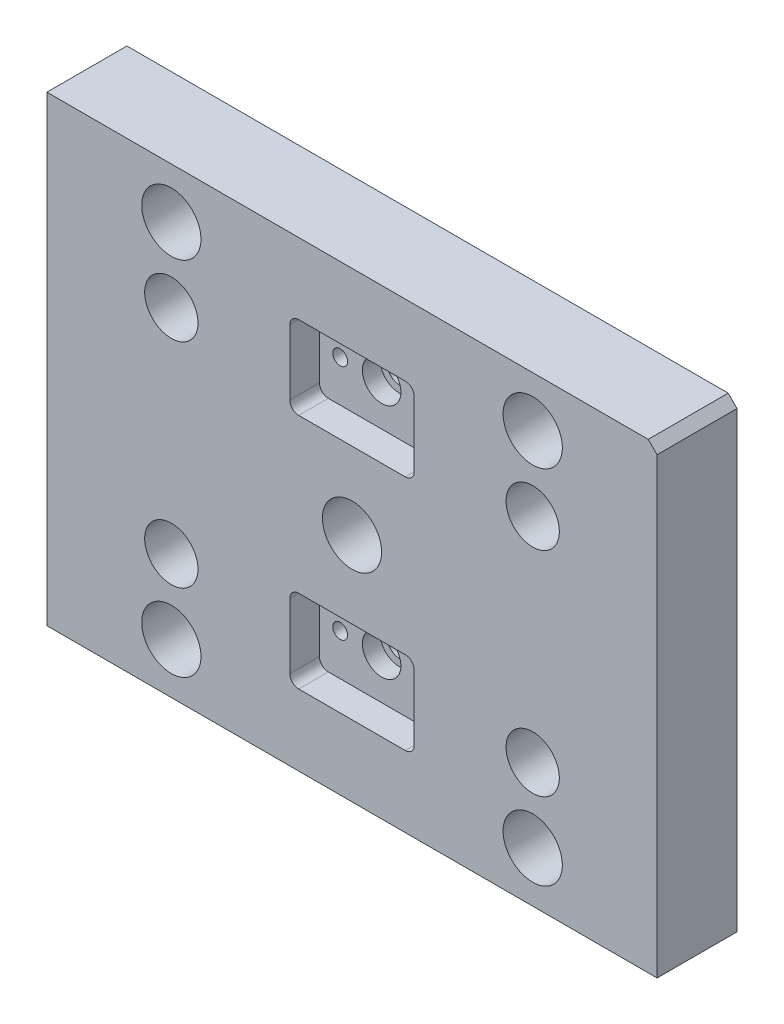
from build123d import *

# Parameters (mm, degrees)
ESQUISSE1_W                 = 206
ESQUISSE1_H                 = 156
EXTRUSION1_DEPTH            = 27
ESQUISSE3_R                 = 10
ESQUISSE3_R_2               = 5.25
ENL_V_MAT_EXTRU_1_DEPTH     = 132.992424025
ESQUISSE13_R                = 9
ENL_V_MAT_EXTRU_9_DEPTH     = 13
SYM_TRIE2_COPY_1_SKETCH_R   = 10
SYM_TRIE2_COPY_1_SKETCH_R_2 = 5.25
SYM_TRIE2_COPY_1_DEPTH      = 132.992424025
SYM_TRIE2_COPY_2_SKETCH_R   = 9
SYM_TRIE2_COPY_2_DEPTH      = 13
ESQUISSE10_W                = 42
ESQUISSE10_H                = 28
ENL_V_MAT_EXTRU_6_DEPTH     = 10
CONG_1_R                    = 3
ESQUISSE17_R                = 10
ENL_V_MAT_EXTRU_12_DEPTH    = 132.992424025
CHANFREIN_D_SIZE            = 3
CONG_1_OF_SYM_TRIE3_R       = 3
ESQUISSE18_R                = 4.1
ENL_V_MAT_EXTRU_13_DEPTH    = 132.992424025
ESQUISSE19_R                = 6.5
ENL_V_MAT_EXTRU_14_DEPTH    = 6
TROU_TARAUD_M61_AT_2_COUNT  = 2
TROU_TARAUD_M61_AT_2_PITCH  = 28


with BuildPart() as part:
    # Esquisse1 → Extrusion1 (new body)
    with BuildSketch(Plane.XY):
        Rectangle(ESQUISSE1_W, ESQUISSE1_H)
    extrude(amount=EXTRUSION1_DEPTH)

    # Esquisse3 → Enl_v. mat.-Extru.1 (cut, through all)
    with BuildSketch(Plane.XY.offset(27)):
        with Locations((-61, 61)):
            Circle(ESQUISSE3_R)
        with Locations((-61, 36)):
            Circle(ESQUISSE3_R_2)
    enl_v_mat_extru_1 = extrude(amount=-ENL_V_MAT_EXTRU_1_DEPTH, mode=Mode.SUBTRACT)

    # Esquisse13 → Enl_v. mat.-Extru.9 (cut)
    with BuildSketch(Plane.XY.offset(27)):
        with Locations((-61, 36)):
            Circle(ESQUISSE13_R)
    enl_v_mat_extru_9 = extrude(amount=-ENL_V_MAT_EXTRU_9_DEPTH, mode=Mode.SUBTRACT)

    # Sym_trie1: Enl_v. mat.-Extru.1, Enl_v. mat.-Extru.9 across plane
    add(enl_v_mat_extru_1.mirror(Plane(origin=(0, 0, 0), x_dir=(0, 0, 1), z_dir=(1, 0, 0))), mode=Mode.SUBTRACT)
    add(enl_v_mat_extru_9.mirror(Plane(origin=(0, 0, 0), x_dir=(0, 0, 1), z_dir=(1, 0, 0))), mode=Mode.SUBTRACT)

    # Sym_trie2: Enl_v. mat.-Extru.1, Enl_v. mat.-Extru.9 across plane
    add(enl_v_mat_extru_1.mirror(Plane.ZX), mode=Mode.SUBTRACT)
    add(enl_v_mat_extru_9.mirror(Plane.ZX), mode=Mode.SUBTRACT)

    # Sym_trie2 copy 1 sketch → Sym_trie2 copy 1 (cut, through all)
    with BuildSketch(Plane(origin=(0, 0, 27), x_dir=(-1, 0, 0), z_dir=(0, 0, 1))):
        with Locations((-61, 61)):
            Circle(SYM_TRIE2_COPY_1_SKETCH_R)
        with Locations((-61, 36)):
            Circle(SYM_TRIE2_COPY_1_SKETCH_R_2)
    extrude(amount=-SYM_TRIE2_COPY_1_DEPTH, mode=Mode.SUBTRACT)

    # Sym_trie2 copy 2 sketch → Sym_trie2 copy 2 (cut)
    with BuildSketch(Plane(origin=(0, 0, 27), x_dir=(-1, 0, 0), z_dir=(0, 0, 1))):
        with Locations((-61, 36)):
            Circle(SYM_TRIE2_COPY_2_SKETCH_R)
    extrude(amount=-SYM_TRIE2_COPY_2_DEPTH, mode=Mode.SUBTRACT)

    # Esquisse10 → Enl_v. mat.-Extru.6 (cut)
    with BuildSketch(Plane.XY.offset(27)):
        with Locations((0, -40)):
            Rectangle(ESQUISSE10_W, ESQUISSE10_H)
    enl_v_mat_extru_6 = extrude(amount=-ENL_V_MAT_EXTRU_6_DEPTH, mode=Mode.SUBTRACT)

    # Cong_1
    cong_1_edges = [part.edges().sort_by_distance(p)[0] for p in [
        (-21, -54, 22),
        (-21, -26, 22),
        (21, -26, 22),
        (21, -54, 22),
    ]]
    fillet(cong_1_edges, radius=CONG_1_R)

    # Esquisse17 → Enl_v. mat.-Extru.12 (cut, through all)
    with BuildSketch(Plane.XY.offset(27)):
        Circle(ESQUISSE17_R)
    extrude(amount=-ENL_V_MAT_EXTRU_12_DEPTH, mode=Mode.SUBTRACT)

    # Chanfrein_D
    chanfrein_d_edges = [part.edges().sort_by_distance(p)[0] for p in [
        (103, 78, 13.5),
    ]]
    chamfer(chanfrein_d_edges, length=CHANFREIN_D_SIZE)

    # Sym_trie3: Enl_v. mat.-Extru.6 across plane
    add(enl_v_mat_extru_6.mirror(Plane.ZX), mode=Mode.SUBTRACT)

    # Cong_1 of Sym_trie3
    cong_1_of_sym_trie3_edges = [part.edges().sort_by_distance(p)[0] for p in [
        (-21, 54, 22),
        (-21, 26, 22),
        (21, 26, 22),
        (21, 54, 22),
    ]]
    fillet(cong_1_of_sym_trie3_edges, radius=CONG_1_OF_SYM_TRIE3_R)

    # Esquisse18 → Enl_v. mat.-Extru.13 (cut, through all)
    with BuildSketch(Plane(origin=(0, 0, 0), x_dir=(-1, 0, 0), z_dir=(0, 0, -1))):
        with Locations((0, -40)):
            Circle(ESQUISSE18_R)
        with Locations((0, 40)):
            Circle(ESQUISSE18_R)
    extrude(amount=-ENL_V_MAT_EXTRU_13_DEPTH, mode=Mode.SUBTRACT)

    # Esquisse19 → Enl_v. mat.-Extru.14 (cut)
    with BuildSketch(Plane.XY.offset(17)):
        with Locations((0, 40)):
            Circle(ESQUISSE19_R)
        with Locations((0, -40)):
            Circle(ESQUISSE19_R)
    extrude(amount=-ENL_V_MAT_EXTRU_14_DEPTH, mode=Mode.SUBTRACT)

    # Esquisse21 → Trou taraud_ M61 (revolve, cut)
    with BuildSketch(Plane(origin=(14, 40, 17), x_dir=(0, -1, 0), z_dir=(1, 0, 0))):
        Polygon((0, 0), (0, 18.502151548), (2.5, 17), (2.5, 0), align=None)
    trou_taraud_m61 = revolve(axis=Axis((14, 40, 23.35), (0, 0, -1)), mode=Mode.SUBTRACT)

    # Trou taraud_ M61 at 2: Trou taraud_ M61 ×2
    with Locations(*[(-i * TROU_TARAUD_M61_AT_2_PITCH, 0, 0) for i in range(1, TROU_TARAUD_M61_AT_2_COUNT)]):
        add(trou_taraud_m61, mode=Mode.SUBTRACT)

    # Sym_trie4: Trou taraud_ M61 across plane
    add(trou_taraud_m61.mirror(Plane.ZX), mode=Mode.SUBTRACT)

    # Sym_trie4 copy 1 sketch → Sym_trie4 copy 1 (revolve, cut)
    with BuildSketch(Plane(origin=(-14, -40, 17), x_dir=(0, 1, 0), z_dir=(1, 0, 0))):
        Polygon((0, 0), (0, -18.502151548), (2.5, -17), (2.5, 0), align=None)
    revolve(axis=Axis((-14, -40, 23.35), (0, 0, 1)), mode=Mode.SUBTRACT)


solid = part.part
